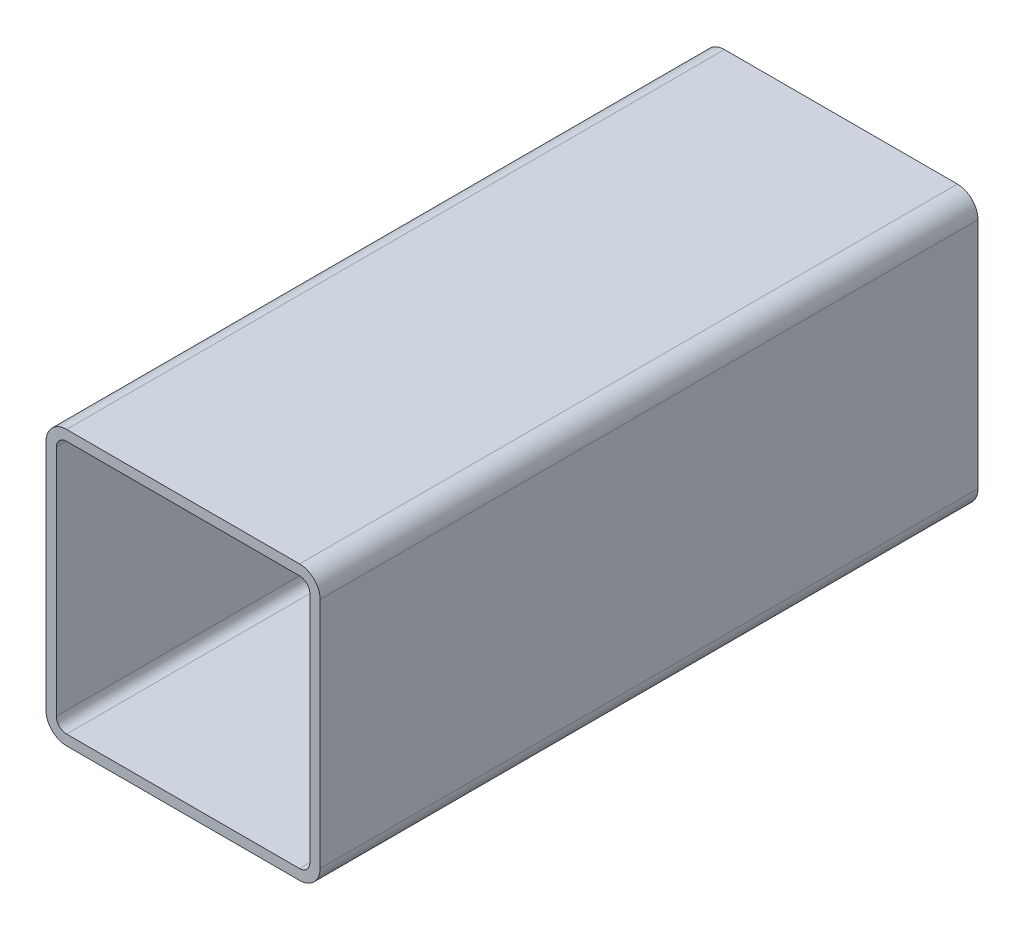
ISO-10303-21;
HEADER;
FILE_DESCRIPTION(('STEP AP214'),'2;1');
FILE_NAME('part.step','',(''),(''),'','','');
FILE_SCHEMA(('AUTOMOTIVE_DESIGN { 1 0 10303 214 1 1 1 1 }'));
ENDSEC;
DATA;
#1=APPLICATION_CONTEXT('core data for automotive mechanical design processes');
#2=APPLICATION_PROTOCOL_DEFINITION('international standard','automotive_design',2000,#1);
#3=PRODUCT_CONTEXT('',#1,'mechanical');
#4=PRODUCT('Part','Part','',(#3));
#5=PRODUCT_RELATED_PRODUCT_CATEGORY('part','',(#4));
#6=PRODUCT_DEFINITION_FORMATION('','',#4);
#7=PRODUCT_DEFINITION_CONTEXT('part definition',#1,'design');
#8=PRODUCT_DEFINITION('design','',#6,#7);
#9=PRODUCT_DEFINITION_SHAPE('','',#8);
#10=(LENGTH_UNIT() NAMED_UNIT(*) SI_UNIT(.MILLI.,.METRE.));
#11=(NAMED_UNIT(*) PLANE_ANGLE_UNIT() SI_UNIT($,.RADIAN.));
#12=(NAMED_UNIT(*) SI_UNIT($,.STERADIAN.) SOLID_ANGLE_UNIT());
#13=UNCERTAINTY_MEASURE_WITH_UNIT(LENGTH_MEASURE(1.E-05),#10,'distance_accuracy_value','');
#14=(GEOMETRIC_REPRESENTATION_CONTEXT(3) GLOBAL_UNCERTAINTY_ASSIGNED_CONTEXT((#13)) GLOBAL_UNIT_ASSIGNED_CONTEXT((#10,
#11,#12)) REPRESENTATION_CONTEXT('',''));
#15=CARTESIAN_POINT('',(0.,0.,0.));
#16=DIRECTION('',(0.,0.,1.));
#17=DIRECTION('',(1.,0.,0.));
#18=AXIS2_PLACEMENT_3D('',#15,#16,#17);
#19=CARTESIAN_POINT('',(10.3862396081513,119.50985662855,304.8));
#20=DIRECTION('',(0.,0.,1.));
#21=DIRECTION('',(1.,0.,0.));
#22=AXIS2_PLACEMENT_3D('',#19,#20,#21);
#23=PLANE('',#22);
#24=CARTESIAN_POINT('',(10.3862396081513,119.50985662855,304.8));
#25=DIRECTION('',(0.,0.,1.));
#26=DIRECTION('',(1.,0.,0.));
#27=AXIS2_PLACEMENT_3D('',#24,#25,#26);
#28=CIRCLE('',#27,9.52499999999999);
#29=CARTESIAN_POINT('',(10.3862396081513,129.03485662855,304.8));
#30=VERTEX_POINT('',#29);
#31=CARTESIAN_POINT('',(0.8612396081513,119.50985662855,304.8));
#32=VERTEX_POINT('',#31);
#33=EDGE_CURVE('E211',#30,#32,#28,.T.);
#34=ORIENTED_EDGE('',*,*,#33,.T.);
#35=DIRECTION('',(0.,-1.,0.));
#36=VECTOR('',#35,1.);
#37=CARTESIAN_POINT('',(0.8612396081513,11.5598566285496,304.8));
#38=LINE('',#37,#36);
#39=CARTESIAN_POINT('',(0.8612396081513,11.5598566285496,304.8));
#40=VERTEX_POINT('',#39);
#41=EDGE_CURVE('E214',#32,#40,#38,.T.);
#42=ORIENTED_EDGE('',*,*,#41,.T.);
#43=CARTESIAN_POINT('',(10.3862396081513,11.5598566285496,304.8));
#44=DIRECTION('',(0.,0.,1.));
#45=DIRECTION('',(1.,0.,0.));
#46=AXIS2_PLACEMENT_3D('',#43,#44,#45);
#47=CIRCLE('',#46,9.525);
#48=CARTESIAN_POINT('',(10.3862396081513,2.03485662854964,304.8));
#49=VERTEX_POINT('',#48);
#50=EDGE_CURVE('E217',#40,#49,#47,.T.);
#51=ORIENTED_EDGE('',*,*,#50,.T.);
#52=DIRECTION('',(1.,0.,0.));
#53=VECTOR('',#52,1.);
#54=CARTESIAN_POINT('',(118.336239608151,2.03485662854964,304.8));
#55=LINE('',#54,#53);
#56=CARTESIAN_POINT('',(118.336239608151,2.03485662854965,304.8));
#57=VERTEX_POINT('',#56);
#58=EDGE_CURVE('E219',#49,#57,#55,.T.);
#59=ORIENTED_EDGE('',*,*,#58,.T.);
#60=CARTESIAN_POINT('',(118.336239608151,11.5598566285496,304.8));
#61=DIRECTION('',(0.,0.,1.));
#62=DIRECTION('',(1.,0.,0.));
#63=AXIS2_PLACEMENT_3D('',#60,#61,#62);
#64=CIRCLE('',#63,9.525);
#65=CARTESIAN_POINT('',(127.861239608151,11.5598566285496,304.8));
#66=VERTEX_POINT('',#65);
#67=EDGE_CURVE('E221',#57,#66,#64,.T.);
#68=ORIENTED_EDGE('',*,*,#67,.T.);
#69=DIRECTION('',(0.,1.,0.));
#70=VECTOR('',#69,1.);
#71=CARTESIAN_POINT('',(127.861239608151,119.50985662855,304.8));
#72=LINE('',#71,#70);
#73=CARTESIAN_POINT('',(127.861239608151,119.50985662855,304.8));
#74=VERTEX_POINT('',#73);
#75=EDGE_CURVE('E223',#66,#74,#72,.T.);
#76=ORIENTED_EDGE('',*,*,#75,.T.);
#77=CARTESIAN_POINT('',(118.336239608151,119.50985662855,304.8));
#78=DIRECTION('',(0.,0.,1.));
#79=DIRECTION('',(1.,0.,0.));
#80=AXIS2_PLACEMENT_3D('',#77,#78,#79);
#81=CIRCLE('',#80,9.52499999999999);
#82=CARTESIAN_POINT('',(118.336239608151,129.03485662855,304.8));
#83=VERTEX_POINT('',#82);
#84=EDGE_CURVE('E225',#74,#83,#81,.T.);
#85=ORIENTED_EDGE('',*,*,#84,.T.);
#86=DIRECTION('',(-1.,0.,0.));
#87=VECTOR('',#86,1.);
#88=CARTESIAN_POINT('',(10.3862396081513,129.03485662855,304.8));
#89=LINE('',#88,#87);
#90=EDGE_CURVE('E227',#83,#30,#89,.T.);
#91=ORIENTED_EDGE('',*,*,#90,.T.);
#92=EDGE_LOOP('',(#34,#42,#51,#59,#68,#76,#85,#91));
#93=FACE_BOUND('',#92,.T.);
#94=DIRECTION('',(0.,-1.,0.));
#95=VECTOR('',#94,1.);
#96=CARTESIAN_POINT('',(5.6237396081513,11.5598566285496,304.8));
#97=LINE('',#96,#95);
#98=CARTESIAN_POINT('',(5.6237396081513,119.50985662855,304.8));
#99=VERTEX_POINT('',#98);
#100=CARTESIAN_POINT('',(5.6237396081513,11.5598566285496,304.8));
#101=VERTEX_POINT('',#100);
#102=EDGE_CURVE('E154',#99,#101,#97,.T.);
#103=ORIENTED_EDGE('',*,*,#102,.F.);
#104=CARTESIAN_POINT('',(10.3862396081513,119.50985662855,304.8));
#105=DIRECTION('',(0.,0.,1.));
#106=DIRECTION('',(1.,0.,0.));
#107=AXIS2_PLACEMENT_3D('',#104,#105,#106);
#108=CIRCLE('',#107,4.7625);
#109=CARTESIAN_POINT('',(10.3862396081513,124.27235662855,304.8));
#110=VERTEX_POINT('',#109);
#111=EDGE_CURVE('E146',#110,#99,#108,.T.);
#112=ORIENTED_EDGE('',*,*,#111,.F.);
#113=DIRECTION('',(-1.,0.,0.));
#114=VECTOR('',#113,1.);
#115=CARTESIAN_POINT('',(10.3862396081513,124.27235662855,304.8));
#116=LINE('',#115,#114);
#117=CARTESIAN_POINT('',(118.336239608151,124.27235662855,304.8));
#118=VERTEX_POINT('',#117);
#119=EDGE_CURVE('E179',#118,#110,#116,.T.);
#120=ORIENTED_EDGE('',*,*,#119,.F.);
#121=CARTESIAN_POINT('',(118.336239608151,119.50985662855,304.8));
#122=DIRECTION('',(0.,0.,1.));
#123=DIRECTION('',(1.,0.,0.));
#124=AXIS2_PLACEMENT_3D('',#121,#122,#123);
#125=CIRCLE('',#124,4.7625);
#126=CARTESIAN_POINT('',(123.098739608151,119.50985662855,304.8));
#127=VERTEX_POINT('',#126);
#128=EDGE_CURVE('E177',#127,#118,#125,.T.);
#129=ORIENTED_EDGE('',*,*,#128,.F.);
#130=DIRECTION('',(0.,1.,0.));
#131=VECTOR('',#130,1.);
#132=CARTESIAN_POINT('',(123.098739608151,119.50985662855,304.8));
#133=LINE('',#132,#131);
#134=CARTESIAN_POINT('',(123.098739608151,11.5598566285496,304.8));
#135=VERTEX_POINT('',#134);
#136=EDGE_CURVE('E175',#135,#127,#133,.T.);
#137=ORIENTED_EDGE('',*,*,#136,.F.);
#138=CARTESIAN_POINT('',(118.336239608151,11.5598566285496,304.8));
#139=DIRECTION('',(0.,0.,1.));
#140=DIRECTION('',(1.,0.,0.));
#141=AXIS2_PLACEMENT_3D('',#138,#139,#140);
#142=CIRCLE('',#141,4.7625);
#143=CARTESIAN_POINT('',(118.336239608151,6.79735662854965,304.8));
#144=VERTEX_POINT('',#143);
#145=EDGE_CURVE('E173',#144,#135,#142,.T.);
#146=ORIENTED_EDGE('',*,*,#145,.F.);
#147=DIRECTION('',(1.,0.,0.));
#148=VECTOR('',#147,1.);
#149=CARTESIAN_POINT('',(118.336239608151,6.79735662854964,304.8));
#150=LINE('',#149,#148);
#151=CARTESIAN_POINT('',(10.3862396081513,6.79735662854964,304.8));
#152=VERTEX_POINT('',#151);
#153=EDGE_CURVE('E169',#152,#144,#150,.T.);
#154=ORIENTED_EDGE('',*,*,#153,.F.);
#155=CARTESIAN_POINT('',(10.3862396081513,11.5598566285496,304.8));
#156=DIRECTION('',(0.,0.,1.));
#157=DIRECTION('',(1.,0.,0.));
#158=AXIS2_PLACEMENT_3D('',#155,#156,#157);
#159=CIRCLE('',#158,4.7625);
#160=EDGE_CURVE('E167',#101,#152,#159,.T.);
#161=ORIENTED_EDGE('',*,*,#160,.F.);
#162=EDGE_LOOP('',(#103,#112,#120,#129,#137,#146,#154,#161));
#163=FACE_BOUND('',#162,.T.);
#164=ADVANCED_FACE('F33',(#93,#163),#23,.T.);
#165=CARTESIAN_POINT('',(10.3862396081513,119.50985662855,0.));
#166=DIRECTION('',(0.,0.,1.));
#167=DIRECTION('',(1.,0.,0.));
#168=AXIS2_PLACEMENT_3D('',#165,#166,#167);
#169=PLANE('',#168);
#170=CARTESIAN_POINT('',(10.3862396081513,119.50985662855,0.));
#171=DIRECTION('',(0.,0.,1.));
#172=DIRECTION('',(1.,0.,0.));
#173=AXIS2_PLACEMENT_3D('',#170,#171,#172);
#174=CIRCLE('',#173,9.52499999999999);
#175=CARTESIAN_POINT('',(10.3862396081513,129.03485662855,0.));
#176=VERTEX_POINT('',#175);
#177=CARTESIAN_POINT('',(0.8612396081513,119.50985662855,0.));
#178=VERTEX_POINT('',#177);
#179=EDGE_CURVE('E162',#176,#178,#174,.T.);
#180=ORIENTED_EDGE('',*,*,#179,.F.);
#181=DIRECTION('',(-1.,0.,0.));
#182=VECTOR('',#181,1.);
#183=CARTESIAN_POINT('',(10.3862396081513,129.03485662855,0.));
#184=LINE('',#183,#182);
#185=CARTESIAN_POINT('',(118.336239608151,129.03485662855,0.));
#186=VERTEX_POINT('',#185);
#187=EDGE_CURVE('E215',#186,#176,#184,.T.);
#188=ORIENTED_EDGE('',*,*,#187,.F.);
#189=CARTESIAN_POINT('',(118.336239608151,119.50985662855,0.));
#190=DIRECTION('',(0.,0.,1.));
#191=DIRECTION('',(1.,0.,0.));
#192=AXIS2_PLACEMENT_3D('',#189,#190,#191);
#193=CIRCLE('',#192,9.52499999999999);
#194=CARTESIAN_POINT('',(127.861239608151,119.50985662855,0.));
#195=VERTEX_POINT('',#194);
#196=EDGE_CURVE('E242',#195,#186,#193,.T.);
#197=ORIENTED_EDGE('',*,*,#196,.F.);
#198=DIRECTION('',(0.,1.,0.));
#199=VECTOR('',#198,1.);
#200=CARTESIAN_POINT('',(127.861239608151,119.50985662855,0.));
#201=LINE('',#200,#199);
#202=CARTESIAN_POINT('',(127.861239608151,11.5598566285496,0.));
#203=VERTEX_POINT('',#202);
#204=EDGE_CURVE('E240',#203,#195,#201,.T.);
#205=ORIENTED_EDGE('',*,*,#204,.F.);
#206=CARTESIAN_POINT('',(118.336239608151,11.5598566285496,0.));
#207=DIRECTION('',(0.,0.,1.));
#208=DIRECTION('',(1.,0.,0.));
#209=AXIS2_PLACEMENT_3D('',#206,#207,#208);
#210=CIRCLE('',#209,9.525);
#211=CARTESIAN_POINT('',(118.336239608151,2.03485662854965,0.));
#212=VERTEX_POINT('',#211);
#213=EDGE_CURVE('E238',#212,#203,#210,.T.);
#214=ORIENTED_EDGE('',*,*,#213,.F.);
#215=DIRECTION('',(1.,0.,0.));
#216=VECTOR('',#215,1.);
#217=CARTESIAN_POINT('',(118.336239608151,2.03485662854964,0.));
#218=LINE('',#217,#216);
#219=CARTESIAN_POINT('',(10.3862396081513,2.03485662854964,0.));
#220=VERTEX_POINT('',#219);
#221=EDGE_CURVE('E236',#220,#212,#218,.T.);
#222=ORIENTED_EDGE('',*,*,#221,.F.);
#223=CARTESIAN_POINT('',(10.3862396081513,11.5598566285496,0.));
#224=DIRECTION('',(0.,0.,1.));
#225=DIRECTION('',(1.,0.,0.));
#226=AXIS2_PLACEMENT_3D('',#223,#224,#225);
#227=CIRCLE('',#226,9.525);
#228=CARTESIAN_POINT('',(0.8612396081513,11.5598566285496,0.));
#229=VERTEX_POINT('',#228);
#230=EDGE_CURVE('E234',#229,#220,#227,.T.);
#231=ORIENTED_EDGE('',*,*,#230,.F.);
#232=DIRECTION('',(0.,-1.,0.));
#233=VECTOR('',#232,1.);
#234=CARTESIAN_POINT('',(0.8612396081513,11.5598566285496,0.));
#235=LINE('',#234,#233);
#236=EDGE_CURVE('E232',#178,#229,#235,.T.);
#237=ORIENTED_EDGE('',*,*,#236,.F.);
#238=EDGE_LOOP('',(#180,#188,#197,#205,#214,#222,#231,#237));
#239=FACE_BOUND('',#238,.T.);
#240=CARTESIAN_POINT('',(10.3862396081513,119.50985662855,0.));
#241=DIRECTION('',(0.,0.,1.));
#242=DIRECTION('',(1.,0.,0.));
#243=AXIS2_PLACEMENT_3D('',#240,#241,#242);
#244=CIRCLE('',#243,4.7625);
#245=CARTESIAN_POINT('',(10.3862396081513,124.27235662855,0.));
#246=VERTEX_POINT('',#245);
#247=CARTESIAN_POINT('',(5.6237396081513,119.50985662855,0.));
#248=VERTEX_POINT('',#247);
#249=EDGE_CURVE('E56',#246,#248,#244,.T.);
#250=ORIENTED_EDGE('',*,*,#249,.T.);
#251=DIRECTION('',(0.,-1.,0.));
#252=VECTOR('',#251,1.);
#253=CARTESIAN_POINT('',(5.6237396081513,11.5598566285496,0.));
#254=LINE('',#253,#252);
#255=CARTESIAN_POINT('',(5.6237396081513,11.5598566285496,0.));
#256=VERTEX_POINT('',#255);
#257=EDGE_CURVE('E161',#248,#256,#254,.T.);
#258=ORIENTED_EDGE('',*,*,#257,.T.);
#259=CARTESIAN_POINT('',(10.3862396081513,11.5598566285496,0.));
#260=DIRECTION('',(0.,0.,1.));
#261=DIRECTION('',(1.,0.,0.));
#262=AXIS2_PLACEMENT_3D('',#259,#260,#261);
#263=CIRCLE('',#262,4.7625);
#264=CARTESIAN_POINT('',(10.3862396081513,6.79735662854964,0.));
#265=VERTEX_POINT('',#264);
#266=EDGE_CURVE('E183',#256,#265,#263,.T.);
#267=ORIENTED_EDGE('',*,*,#266,.T.);
#268=DIRECTION('',(1.,0.,0.));
#269=VECTOR('',#268,1.);
#270=CARTESIAN_POINT('',(118.336239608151,6.79735662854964,0.));
#271=LINE('',#270,#269);
#272=CARTESIAN_POINT('',(118.336239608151,6.79735662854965,0.));
#273=VERTEX_POINT('',#272);
#274=EDGE_CURVE('E186',#265,#273,#271,.T.);
#275=ORIENTED_EDGE('',*,*,#274,.T.);
#276=CARTESIAN_POINT('',(118.336239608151,11.5598566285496,0.));
#277=DIRECTION('',(0.,0.,1.));
#278=DIRECTION('',(1.,0.,0.));
#279=AXIS2_PLACEMENT_3D('',#276,#277,#278);
#280=CIRCLE('',#279,4.7625);
#281=CARTESIAN_POINT('',(123.098739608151,11.5598566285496,0.));
#282=VERTEX_POINT('',#281);
#283=EDGE_CURVE('E189',#273,#282,#280,.T.);
#284=ORIENTED_EDGE('',*,*,#283,.T.);
#285=DIRECTION('',(0.,1.,0.));
#286=VECTOR('',#285,1.);
#287=CARTESIAN_POINT('',(123.098739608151,119.50985662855,0.));
#288=LINE('',#287,#286);
#289=CARTESIAN_POINT('',(123.098739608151,119.50985662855,0.));
#290=VERTEX_POINT('',#289);
#291=EDGE_CURVE('E192',#282,#290,#288,.T.);
#292=ORIENTED_EDGE('',*,*,#291,.T.);
#293=CARTESIAN_POINT('',(118.336239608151,119.50985662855,0.));
#294=DIRECTION('',(0.,0.,1.));
#295=DIRECTION('',(1.,0.,0.));
#296=AXIS2_PLACEMENT_3D('',#293,#294,#295);
#297=CIRCLE('',#296,4.7625);
#298=CARTESIAN_POINT('',(118.336239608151,124.27235662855,0.));
#299=VERTEX_POINT('',#298);
#300=EDGE_CURVE('E195',#290,#299,#297,.T.);
#301=ORIENTED_EDGE('',*,*,#300,.T.);
#302=DIRECTION('',(-1.,0.,0.));
#303=VECTOR('',#302,1.);
#304=CARTESIAN_POINT('',(10.3862396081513,124.27235662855,0.));
#305=LINE('',#304,#303);
#306=EDGE_CURVE('E155',#299,#246,#305,.T.);
#307=ORIENTED_EDGE('',*,*,#306,.T.);
#308=EDGE_LOOP('',(#250,#258,#267,#275,#284,#292,#301,#307));
#309=FACE_BOUND('',#308,.T.);
#310=ADVANCED_FACE('F272',(#239,#309),#169,.F.);
#311=CARTESIAN_POINT('',(10.3862396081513,119.50985662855,304.8));
#312=DIRECTION('',(0.,0.,-1.));
#313=DIRECTION('',(-1.,0.,0.));
#314=AXIS2_PLACEMENT_3D('',#311,#312,#313);
#315=CYLINDRICAL_SURFACE('',#314,9.52499999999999);
#316=ORIENTED_EDGE('',*,*,#179,.T.);
#317=DIRECTION('',(0.,0.,-1.));
#318=VECTOR('',#317,1.);
#319=CARTESIAN_POINT('',(0.8612396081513,119.50985662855,304.8));
#320=LINE('',#319,#318);
#321=EDGE_CURVE('E11',#32,#178,#320,.T.);
#322=ORIENTED_EDGE('',*,*,#321,.F.);
#323=ORIENTED_EDGE('',*,*,#33,.F.);
#324=DIRECTION('',(0.,0.,-1.));
#325=VECTOR('',#324,1.);
#326=CARTESIAN_POINT('',(10.3862396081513,129.03485662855,304.8));
#327=LINE('',#326,#325);
#328=EDGE_CURVE('E229',#30,#176,#327,.T.);
#329=ORIENTED_EDGE('',*,*,#328,.T.);
#330=EDGE_LOOP('',(#316,#322,#323,#329));
#331=FACE_BOUND('',#330,.T.);
#332=ADVANCED_FACE('F35',(#331),#315,.T.);
#333=CARTESIAN_POINT('',(0.8612396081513,11.5598566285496,304.8));
#334=DIRECTION('',(1.,0.,0.));
#335=DIRECTION('',(0.,0.,-1.));
#336=AXIS2_PLACEMENT_3D('',#333,#334,#335);
#337=PLANE('',#336);
#338=ORIENTED_EDGE('',*,*,#236,.T.);
#339=DIRECTION('',(0.,0.,-1.));
#340=VECTOR('',#339,1.);
#341=CARTESIAN_POINT('',(0.8612396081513,11.5598566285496,304.8));
#342=LINE('',#341,#340);
#343=EDGE_CURVE('E41',#40,#229,#342,.T.);
#344=ORIENTED_EDGE('',*,*,#343,.F.);
#345=ORIENTED_EDGE('',*,*,#41,.F.);
#346=ORIENTED_EDGE('',*,*,#321,.T.);
#347=EDGE_LOOP('',(#338,#344,#345,#346));
#348=FACE_BOUND('',#347,.T.);
#349=ADVANCED_FACE('F289',(#348),#337,.F.);
#350=CARTESIAN_POINT('',(10.3862396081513,11.5598566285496,304.8));
#351=DIRECTION('',(0.,0.,-1.));
#352=DIRECTION('',(-1.,0.,0.));
#353=AXIS2_PLACEMENT_3D('',#350,#351,#352);
#354=CYLINDRICAL_SURFACE('',#353,9.525);
#355=ORIENTED_EDGE('',*,*,#230,.T.);
#356=DIRECTION('',(0.,0.,-1.));
#357=VECTOR('',#356,1.);
#358=CARTESIAN_POINT('',(10.3862396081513,2.03485662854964,304.8));
#359=LINE('',#358,#357);
#360=EDGE_CURVE('E259',#49,#220,#359,.T.);
#361=ORIENTED_EDGE('',*,*,#360,.F.);
#362=ORIENTED_EDGE('',*,*,#50,.F.);
#363=ORIENTED_EDGE('',*,*,#343,.T.);
#364=EDGE_LOOP('',(#355,#361,#362,#363));
#365=FACE_BOUND('',#364,.T.);
#366=ADVANCED_FACE('F266',(#365),#354,.T.);
#367=CARTESIAN_POINT('',(118.336239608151,2.03485662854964,304.8));
#368=DIRECTION('',(0.,1.,0.));
#369=DIRECTION('',(0.,0.,1.));
#370=AXIS2_PLACEMENT_3D('',#367,#368,#369);
#371=PLANE('',#370);
#372=ORIENTED_EDGE('',*,*,#221,.T.);
#373=DIRECTION('',(0.,0.,-1.));
#374=VECTOR('',#373,1.);
#375=CARTESIAN_POINT('',(118.336239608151,2.03485662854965,304.8));
#376=LINE('',#375,#374);
#377=EDGE_CURVE('E256',#57,#212,#376,.T.);
#378=ORIENTED_EDGE('',*,*,#377,.F.);
#379=ORIENTED_EDGE('',*,*,#58,.F.);
#380=ORIENTED_EDGE('',*,*,#360,.T.);
#381=EDGE_LOOP('',(#372,#378,#379,#380));
#382=FACE_BOUND('',#381,.T.);
#383=ADVANCED_FACE('F278',(#382),#371,.F.);
#384=CARTESIAN_POINT('',(118.336239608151,11.5598566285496,304.8));
#385=DIRECTION('',(0.,0.,-1.));
#386=DIRECTION('',(-1.,0.,0.));
#387=AXIS2_PLACEMENT_3D('',#384,#385,#386);
#388=CYLINDRICAL_SURFACE('',#387,9.525);
#389=ORIENTED_EDGE('',*,*,#213,.T.);
#390=DIRECTION('',(0.,0.,-1.));
#391=VECTOR('',#390,1.);
#392=CARTESIAN_POINT('',(127.861239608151,11.5598566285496,304.8));
#393=LINE('',#392,#391);
#394=EDGE_CURVE('E253',#66,#203,#393,.T.);
#395=ORIENTED_EDGE('',*,*,#394,.F.);
#396=ORIENTED_EDGE('',*,*,#67,.F.);
#397=ORIENTED_EDGE('',*,*,#377,.T.);
#398=EDGE_LOOP('',(#389,#395,#396,#397));
#399=FACE_BOUND('',#398,.T.);
#400=ADVANCED_FACE('F282',(#399),#388,.T.);
#401=CARTESIAN_POINT('',(127.861239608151,119.50985662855,304.8));
#402=DIRECTION('',(-1.,0.,0.));
#403=DIRECTION('',(0.,0.,1.));
#404=AXIS2_PLACEMENT_3D('',#401,#402,#403);
#405=PLANE('',#404);
#406=ORIENTED_EDGE('',*,*,#204,.T.);
#407=DIRECTION('',(0.,0.,-1.));
#408=VECTOR('',#407,1.);
#409=CARTESIAN_POINT('',(127.861239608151,119.50985662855,304.8));
#410=LINE('',#409,#408);
#411=EDGE_CURVE('E250',#74,#195,#410,.T.);
#412=ORIENTED_EDGE('',*,*,#411,.F.);
#413=ORIENTED_EDGE('',*,*,#75,.F.);
#414=ORIENTED_EDGE('',*,*,#394,.T.);
#415=EDGE_LOOP('',(#406,#412,#413,#414));
#416=FACE_BOUND('',#415,.T.);
#417=ADVANCED_FACE('F302',(#416),#405,.F.);
#418=CARTESIAN_POINT('',(118.336239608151,119.50985662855,304.8));
#419=DIRECTION('',(0.,0.,-1.));
#420=DIRECTION('',(-1.,0.,0.));
#421=AXIS2_PLACEMENT_3D('',#418,#419,#420);
#422=CYLINDRICAL_SURFACE('',#421,9.52499999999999);
#423=ORIENTED_EDGE('',*,*,#196,.T.);
#424=DIRECTION('',(0.,0.,-1.));
#425=VECTOR('',#424,1.);
#426=CARTESIAN_POINT('',(118.336239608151,129.03485662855,304.8));
#427=LINE('',#426,#425);
#428=EDGE_CURVE('E247',#83,#186,#427,.T.);
#429=ORIENTED_EDGE('',*,*,#428,.F.);
#430=ORIENTED_EDGE('',*,*,#84,.F.);
#431=ORIENTED_EDGE('',*,*,#411,.T.);
#432=EDGE_LOOP('',(#423,#429,#430,#431));
#433=FACE_BOUND('',#432,.T.);
#434=ADVANCED_FACE('F300',(#433),#422,.T.);
#435=CARTESIAN_POINT('',(10.3862396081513,129.03485662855,304.8));
#436=DIRECTION('',(0.,-1.,0.));
#437=DIRECTION('',(0.,0.,-1.));
#438=AXIS2_PLACEMENT_3D('',#435,#436,#437);
#439=PLANE('',#438);
#440=ORIENTED_EDGE('',*,*,#187,.T.);
#441=ORIENTED_EDGE('',*,*,#328,.F.);
#442=ORIENTED_EDGE('',*,*,#90,.F.);
#443=ORIENTED_EDGE('',*,*,#428,.T.);
#444=EDGE_LOOP('',(#440,#441,#442,#443));
#445=FACE_BOUND('',#444,.T.);
#446=ADVANCED_FACE('F295',(#445),#439,.F.);
#447=CARTESIAN_POINT('',(10.3862396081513,119.50985662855,304.8));
#448=DIRECTION('',(0.,0.,-1.));
#449=DIRECTION('',(-1.,0.,0.));
#450=AXIS2_PLACEMENT_3D('',#447,#448,#449);
#451=CYLINDRICAL_SURFACE('',#450,4.7625);
#452=ORIENTED_EDGE('',*,*,#249,.F.);
#453=DIRECTION('',(0.,0.,-1.));
#454=VECTOR('',#453,1.);
#455=CARTESIAN_POINT('',(10.3862396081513,124.27235662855,304.8));
#456=LINE('',#455,#454);
#457=EDGE_CURVE('E150',#110,#246,#456,.T.);
#458=ORIENTED_EDGE('',*,*,#457,.F.);
#459=ORIENTED_EDGE('',*,*,#111,.T.);
#460=DIRECTION('',(0.,0.,-1.));
#461=VECTOR('',#460,1.);
#462=CARTESIAN_POINT('',(5.6237396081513,119.50985662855,304.8));
#463=LINE('',#462,#461);
#464=EDGE_CURVE('E149',#99,#248,#463,.T.);
#465=ORIENTED_EDGE('',*,*,#464,.T.);
#466=EDGE_LOOP('',(#452,#458,#459,#465));
#467=FACE_BOUND('',#466,.T.);
#468=ADVANCED_FACE('F148',(#467),#451,.F.);
#469=CARTESIAN_POINT('',(5.6237396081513,11.5598566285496,304.8));
#470=DIRECTION('',(1.,0.,0.));
#471=DIRECTION('',(0.,0.,-1.));
#472=AXIS2_PLACEMENT_3D('',#469,#470,#471);
#473=PLANE('',#472);
#474=ORIENTED_EDGE('',*,*,#257,.F.);
#475=ORIENTED_EDGE('',*,*,#464,.F.);
#476=ORIENTED_EDGE('',*,*,#102,.T.);
#477=DIRECTION('',(0.,0.,-1.));
#478=VECTOR('',#477,1.);
#479=CARTESIAN_POINT('',(5.6237396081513,11.5598566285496,304.8));
#480=LINE('',#479,#478);
#481=EDGE_CURVE('E163',#101,#256,#480,.T.);
#482=ORIENTED_EDGE('',*,*,#481,.T.);
#483=EDGE_LOOP('',(#474,#475,#476,#482));
#484=FACE_BOUND('',#483,.T.);
#485=ADVANCED_FACE('F158',(#484),#473,.T.);
#486=CARTESIAN_POINT('',(10.3862396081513,11.5598566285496,304.8));
#487=DIRECTION('',(0.,0.,-1.));
#488=DIRECTION('',(-1.,0.,0.));
#489=AXIS2_PLACEMENT_3D('',#486,#487,#488);
#490=CYLINDRICAL_SURFACE('',#489,4.7625);
#491=ORIENTED_EDGE('',*,*,#266,.F.);
#492=ORIENTED_EDGE('',*,*,#481,.F.);
#493=ORIENTED_EDGE('',*,*,#160,.T.);
#494=DIRECTION('',(0.,0.,-1.));
#495=VECTOR('',#494,1.);
#496=CARTESIAN_POINT('',(10.3862396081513,6.79735662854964,304.8));
#497=LINE('',#496,#495);
#498=EDGE_CURVE('E208',#152,#265,#497,.T.);
#499=ORIENTED_EDGE('',*,*,#498,.T.);
#500=EDGE_LOOP('',(#491,#492,#493,#499));
#501=FACE_BOUND('',#500,.T.);
#502=ADVANCED_FACE('F327',(#501),#490,.F.);
#503=CARTESIAN_POINT('',(118.336239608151,6.79735662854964,304.8));
#504=DIRECTION('',(0.,1.,0.));
#505=DIRECTION('',(0.,0.,1.));
#506=AXIS2_PLACEMENT_3D('',#503,#504,#505);
#507=PLANE('',#506);
#508=ORIENTED_EDGE('',*,*,#274,.F.);
#509=ORIENTED_EDGE('',*,*,#498,.F.);
#510=ORIENTED_EDGE('',*,*,#153,.T.);
#511=DIRECTION('',(0.,0.,-1.));
#512=VECTOR('',#511,1.);
#513=CARTESIAN_POINT('',(118.336239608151,6.79735662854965,304.8));
#514=LINE('',#513,#512);
#515=EDGE_CURVE('E206',#144,#273,#514,.T.);
#516=ORIENTED_EDGE('',*,*,#515,.T.);
#517=EDGE_LOOP('',(#508,#509,#510,#516));
#518=FACE_BOUND('',#517,.T.);
#519=ADVANCED_FACE('F331',(#518),#507,.T.);
#520=CARTESIAN_POINT('',(118.336239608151,11.5598566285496,304.8));
#521=DIRECTION('',(0.,0.,-1.));
#522=DIRECTION('',(-1.,0.,0.));
#523=AXIS2_PLACEMENT_3D('',#520,#521,#522);
#524=CYLINDRICAL_SURFACE('',#523,4.7625);
#525=ORIENTED_EDGE('',*,*,#283,.F.);
#526=ORIENTED_EDGE('',*,*,#515,.F.);
#527=ORIENTED_EDGE('',*,*,#145,.T.);
#528=DIRECTION('',(0.,0.,-1.));
#529=VECTOR('',#528,1.);
#530=CARTESIAN_POINT('',(123.098739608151,11.5598566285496,304.8));
#531=LINE('',#530,#529);
#532=EDGE_CURVE('E204',#135,#282,#531,.T.);
#533=ORIENTED_EDGE('',*,*,#532,.T.);
#534=EDGE_LOOP('',(#525,#526,#527,#533));
#535=FACE_BOUND('',#534,.T.);
#536=ADVANCED_FACE('F337',(#535),#524,.F.);
#537=CARTESIAN_POINT('',(123.098739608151,119.50985662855,304.8));
#538=DIRECTION('',(-1.,0.,0.));
#539=DIRECTION('',(0.,0.,1.));
#540=AXIS2_PLACEMENT_3D('',#537,#538,#539);
#541=PLANE('',#540);
#542=ORIENTED_EDGE('',*,*,#291,.F.);
#543=ORIENTED_EDGE('',*,*,#532,.F.);
#544=ORIENTED_EDGE('',*,*,#136,.T.);
#545=DIRECTION('',(0.,0.,-1.));
#546=VECTOR('',#545,1.);
#547=CARTESIAN_POINT('',(123.098739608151,119.50985662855,304.8));
#548=LINE('',#547,#546);
#549=EDGE_CURVE('E202',#127,#290,#548,.T.);
#550=ORIENTED_EDGE('',*,*,#549,.T.);
#551=EDGE_LOOP('',(#542,#543,#544,#550));
#552=FACE_BOUND('',#551,.T.);
#553=ADVANCED_FACE('F341',(#552),#541,.T.);
#554=CARTESIAN_POINT('',(118.336239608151,119.50985662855,304.8));
#555=DIRECTION('',(0.,0.,-1.));
#556=DIRECTION('',(-1.,0.,0.));
#557=AXIS2_PLACEMENT_3D('',#554,#555,#556);
#558=CYLINDRICAL_SURFACE('',#557,4.7625);
#559=ORIENTED_EDGE('',*,*,#300,.F.);
#560=ORIENTED_EDGE('',*,*,#549,.F.);
#561=ORIENTED_EDGE('',*,*,#128,.T.);
#562=DIRECTION('',(0.,0.,-1.));
#563=VECTOR('',#562,1.);
#564=CARTESIAN_POINT('',(118.336239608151,124.27235662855,304.8));
#565=LINE('',#564,#563);
#566=EDGE_CURVE('E48',#118,#299,#565,.T.);
#567=ORIENTED_EDGE('',*,*,#566,.T.);
#568=EDGE_LOOP('',(#559,#560,#561,#567));
#569=FACE_BOUND('',#568,.T.);
#570=ADVANCED_FACE('F345',(#569),#558,.F.);
#571=CARTESIAN_POINT('',(10.3862396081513,124.27235662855,304.8));
#572=DIRECTION('',(0.,-1.,0.));
#573=DIRECTION('',(0.,0.,-1.));
#574=AXIS2_PLACEMENT_3D('',#571,#572,#573);
#575=PLANE('',#574);
#576=ORIENTED_EDGE('',*,*,#306,.F.);
#577=ORIENTED_EDGE('',*,*,#566,.F.);
#578=ORIENTED_EDGE('',*,*,#119,.T.);
#579=ORIENTED_EDGE('',*,*,#457,.T.);
#580=EDGE_LOOP('',(#576,#577,#578,#579));
#581=FACE_BOUND('',#580,.T.);
#582=ADVANCED_FACE('F349',(#581),#575,.T.);
#583=CLOSED_SHELL('',(#164,#310,#332,#349,#366,#383,#400,#417,#434,#446,#468,#485,#502,#519,
#536,#553,#570,#582));
#584=MANIFOLD_SOLID_BREP('B2',#583);
#585=ADVANCED_BREP_SHAPE_REPRESENTATION('',(#18,#584),#14);
#586=SHAPE_DEFINITION_REPRESENTATION(#9,#585);
ENDSEC;
END-ISO-10303-21;
